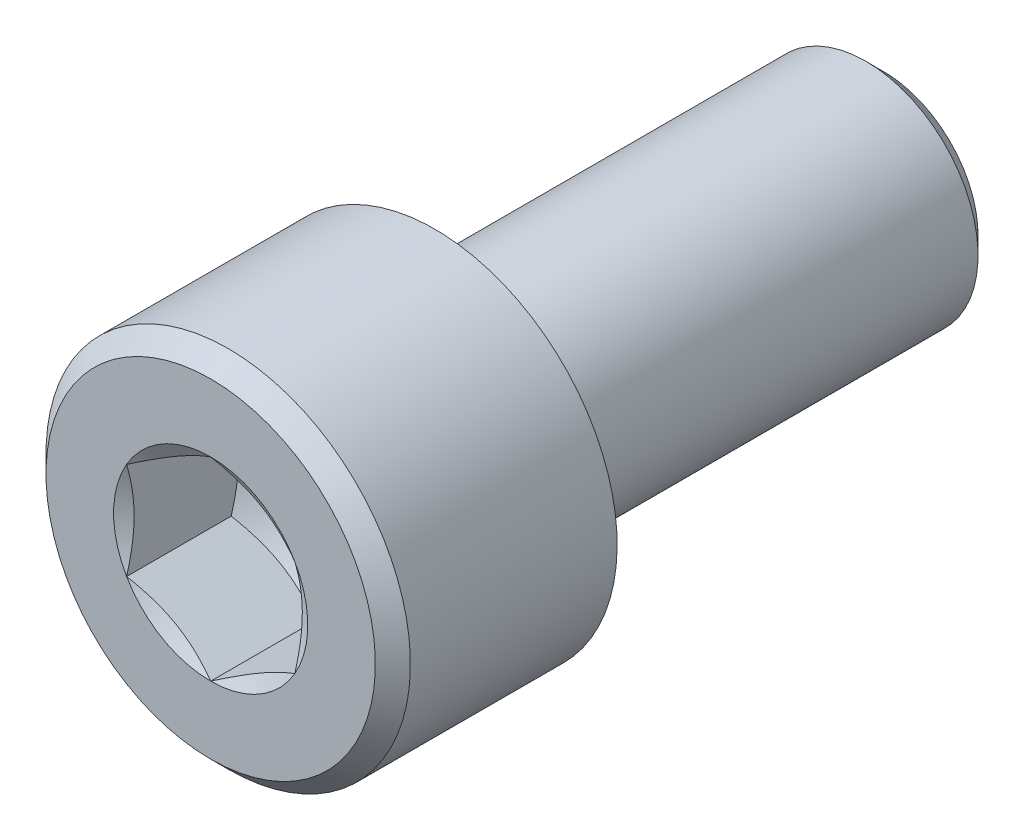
ISO-10303-21;
HEADER;
FILE_DESCRIPTION(('STEP AP214'),'2;1');
FILE_NAME('part.step','',(''),(''),'','','');
FILE_SCHEMA(('AUTOMOTIVE_DESIGN { 1 0 10303 214 1 1 1 1 }'));
ENDSEC;
DATA;
#1=APPLICATION_CONTEXT('core data for automotive mechanical design processes');
#2=APPLICATION_PROTOCOL_DEFINITION('international standard','automotive_design',2000,#1);
#3=PRODUCT_CONTEXT('',#1,'mechanical');
#4=PRODUCT('Part','Part','',(#3));
#5=PRODUCT_RELATED_PRODUCT_CATEGORY('part','',(#4));
#6=PRODUCT_DEFINITION_FORMATION('','',#4);
#7=PRODUCT_DEFINITION_CONTEXT('part definition',#1,'design');
#8=PRODUCT_DEFINITION('design','',#6,#7);
#9=PRODUCT_DEFINITION_SHAPE('','',#8);
#10=(LENGTH_UNIT() NAMED_UNIT(*) SI_UNIT(.MILLI.,.METRE.));
#11=(NAMED_UNIT(*) PLANE_ANGLE_UNIT() SI_UNIT($,.RADIAN.));
#12=(NAMED_UNIT(*) SI_UNIT($,.STERADIAN.) SOLID_ANGLE_UNIT());
#13=UNCERTAINTY_MEASURE_WITH_UNIT(LENGTH_MEASURE(1.E-05),#10,'distance_accuracy_value','');
#14=(GEOMETRIC_REPRESENTATION_CONTEXT(3) GLOBAL_UNCERTAINTY_ASSIGNED_CONTEXT((#13)) GLOBAL_UNIT_ASSIGNED_CONTEXT((#10,
#11,#12)) REPRESENTATION_CONTEXT('',''));
#15=CARTESIAN_POINT('',(0.,0.,0.));
#16=DIRECTION('',(0.,0.,1.));
#17=DIRECTION('',(1.,0.,0.));
#18=AXIS2_PLACEMENT_3D('',#15,#16,#17);
#19=CARTESIAN_POINT('',(0.,6.5,8.));
#20=DIRECTION('',(0.,0.,-1.));
#21=DIRECTION('',(0.,1.,0.));
#22=AXIS2_PLACEMENT_3D('',#19,#20,#21);
#23=PLANE('',#22);
#24=CARTESIAN_POINT('',(0.,0.,8.));
#25=DIRECTION('',(0.,0.,-1.));
#26=DIRECTION('',(0.,1.,0.));
#27=AXIS2_PLACEMENT_3D('',#24,#25,#26);
#28=CIRCLE('',#27,5.875);
#29=CARTESIAN_POINT('',(0.,5.875,8.));
#30=VERTEX_POINT('',#29);
#31=EDGE_CURVE('E297',#30,#30,#28,.F.);
#32=ORIENTED_EDGE('',*,*,#31,.T.);
#33=EDGE_LOOP('',(#32));
#34=FACE_BOUND('',#33,.T.);
#35=CARTESIAN_POINT('',(0.,0.,8.));
#36=DIRECTION('',(0.,0.,-1.));
#37=DIRECTION('',(0.,1.,0.));
#38=AXIS2_PLACEMENT_3D('',#35,#36,#37);
#39=CIRCLE('',#38,3.46410161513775);
#40=CARTESIAN_POINT('',(0.,3.46410161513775,8.));
#41=VERTEX_POINT('',#40);
#42=CARTESIAN_POINT('',(-3.,1.73205080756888,8.));
#43=VERTEX_POINT('',#42);
#44=EDGE_CURVE('E111',#41,#43,#39,.F.);
#45=ORIENTED_EDGE('',*,*,#44,.F.);
#46=CARTESIAN_POINT('',(3.,1.73205080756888,8.));
#47=VERTEX_POINT('',#46);
#48=EDGE_CURVE('E99',#47,#41,#39,.F.);
#49=ORIENTED_EDGE('',*,*,#48,.F.);
#50=CARTESIAN_POINT('',(3.,-1.73205080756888,8.));
#51=VERTEX_POINT('',#50);
#52=EDGE_CURVE('E109',#51,#47,#39,.F.);
#53=ORIENTED_EDGE('',*,*,#52,.F.);
#54=CARTESIAN_POINT('',(0.,-3.46410161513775,8.));
#55=VERTEX_POINT('',#54);
#56=EDGE_CURVE('E440',#55,#51,#39,.F.);
#57=ORIENTED_EDGE('',*,*,#56,.F.);
#58=CARTESIAN_POINT('',(-3.,-1.73205080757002,7.99999999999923));
#59=VERTEX_POINT('',#58);
#60=EDGE_CURVE('E146',#59,#55,#39,.F.);
#61=ORIENTED_EDGE('',*,*,#60,.F.);
#62=EDGE_CURVE('E141',#43,#59,#39,.F.);
#63=ORIENTED_EDGE('',*,*,#62,.F.);
#64=EDGE_LOOP('',(#45,#49,#53,#57,#61,#63));
#65=FACE_BOUND('',#64,.T.);
#66=ADVANCED_FACE('F42',(#34,#65),#23,.F.);
#67=CARTESIAN_POINT('',(0.,4.,0.));
#68=DIRECTION('',(0.,0.,1.));
#69=DIRECTION('',(0.,-1.,0.));
#70=AXIS2_PLACEMENT_3D('',#67,#68,#69);
#71=PLANE('',#70);
#72=CARTESIAN_POINT('',(0.,0.,0.));
#73=DIRECTION('',(0.,0.,1.));
#74=DIRECTION('',(0.,-1.,0.));
#75=AXIS2_PLACEMENT_3D('',#72,#73,#74);
#76=CIRCLE('',#75,4.4);
#77=CARTESIAN_POINT('',(0.,-4.4,0.));
#78=VERTEX_POINT('',#77);
#79=EDGE_CURVE('E51',#78,#78,#76,.T.);
#80=ORIENTED_EDGE('',*,*,#79,.T.);
#81=EDGE_LOOP('',(#80));
#82=FACE_BOUND('',#81,.T.);
#83=CARTESIAN_POINT('',(0.,0.,0.));
#84=DIRECTION('',(0.,0.,1.));
#85=DIRECTION('',(0.,-1.,0.));
#86=AXIS2_PLACEMENT_3D('',#83,#84,#85);
#87=CIRCLE('',#86,6.5);
#88=CARTESIAN_POINT('',(0.,-6.5,0.));
#89=VERTEX_POINT('',#88);
#90=EDGE_CURVE('E448',#89,#89,#87,.T.);
#91=ORIENTED_EDGE('',*,*,#90,.F.);
#92=EDGE_LOOP('',(#91));
#93=FACE_BOUND('',#92,.T.);
#94=ADVANCED_FACE('F259',(#82,#93),#71,.F.);
#95=CARTESIAN_POINT('',(0.,0.,8.));
#96=DIRECTION('',(0.,0.,1.));
#97=DIRECTION('',(0.,-1.,0.));
#98=AXIS2_PLACEMENT_3D('',#95,#96,#97);
#99=CYLINDRICAL_SURFACE('',#98,6.5);
#100=CARTESIAN_POINT('',(0.,0.,7.375));
#101=DIRECTION('',(0.,0.,-1.));
#102=DIRECTION('',(0.,1.,0.));
#103=AXIS2_PLACEMENT_3D('',#100,#101,#102);
#104=CIRCLE('',#103,6.5);
#105=CARTESIAN_POINT('',(0.,6.5,7.375));
#106=VERTEX_POINT('',#105);
#107=EDGE_CURVE('E290',#106,#106,#104,.T.);
#108=ORIENTED_EDGE('',*,*,#107,.T.);
#109=EDGE_LOOP('',(#108));
#110=FACE_BOUND('',#109,.T.);
#111=ORIENTED_EDGE('',*,*,#90,.T.);
#112=EDGE_LOOP('',(#111));
#113=FACE_BOUND('',#112,.T.);
#114=ADVANCED_FACE('F264',(#110,#113),#99,.T.);
#115=CARTESIAN_POINT('',(0.,0.,-16.));
#116=DIRECTION('',(0.,0.,1.));
#117=DIRECTION('',(0.,-1.,0.));
#118=AXIS2_PLACEMENT_3D('',#115,#116,#117);
#119=PLANE('',#118);
#120=CARTESIAN_POINT('',(0.,0.,-16.));
#121=DIRECTION('',(0.,0.,1.));
#122=DIRECTION('',(0.,-1.,0.));
#123=AXIS2_PLACEMENT_3D('',#120,#121,#122);
#124=CIRCLE('',#123,3.375);
#125=CARTESIAN_POINT('',(0.,-3.375,-16.));
#126=VERTEX_POINT('',#125);
#127=EDGE_CURVE('E122',#126,#126,#124,.F.);
#128=ORIENTED_EDGE('',*,*,#127,.T.);
#129=EDGE_LOOP('',(#128));
#130=FACE_BOUND('',#129,.T.);
#131=ADVANCED_FACE('F269',(#130),#119,.F.);
#132=CARTESIAN_POINT('',(0.,0.,8.));
#133=DIRECTION('',(0.,0.,1.));
#134=DIRECTION('',(0.,-1.,0.));
#135=AXIS2_PLACEMENT_3D('',#132,#133,#134);
#136=CYLINDRICAL_SURFACE('',#135,4.);
#137=CARTESIAN_POINT('',(0.,0.,-0.399999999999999));
#138=DIRECTION('',(0.,0.,1.));
#139=DIRECTION('',(0.,-1.,0.));
#140=AXIS2_PLACEMENT_3D('',#137,#138,#139);
#141=CIRCLE('',#140,4.);
#142=CARTESIAN_POINT('',(0.,-4.,-0.399999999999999));
#143=VERTEX_POINT('',#142);
#144=EDGE_CURVE('E12',#143,#143,#141,.F.);
#145=ORIENTED_EDGE('',*,*,#144,.T.);
#146=EDGE_LOOP('',(#145));
#147=FACE_BOUND('',#146,.T.);
#148=CARTESIAN_POINT('',(0.,0.,-15.375));
#149=DIRECTION('',(0.,0.,1.));
#150=DIRECTION('',(0.,-1.,0.));
#151=AXIS2_PLACEMENT_3D('',#148,#149,#150);
#152=CIRCLE('',#151,4.);
#153=CARTESIAN_POINT('',(0.,-4.,-15.375));
#154=VERTEX_POINT('',#153);
#155=EDGE_CURVE('E287',#154,#154,#152,.T.);
#156=ORIENTED_EDGE('',*,*,#155,.T.);
#157=EDGE_LOOP('',(#156));
#158=FACE_BOUND('',#157,.T.);
#159=ADVANCED_FACE('F181',(#147,#158),#136,.T.);
#160=CARTESIAN_POINT('',(0.,0.,8.));
#161=DIRECTION('',(0.,0.,-1.));
#162=DIRECTION('',(0.,1.,0.));
#163=AXIS2_PLACEMENT_3D('',#160,#161,#162);
#164=CONICAL_SURFACE('',#163,5.875,0.785398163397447);
#165=ORIENTED_EDGE('',*,*,#107,.F.);
#166=EDGE_LOOP('',(#165));
#167=FACE_BOUND('',#166,.T.);
#168=ORIENTED_EDGE('',*,*,#31,.F.);
#169=EDGE_LOOP('',(#168));
#170=FACE_BOUND('',#169,.T.);
#171=ADVANCED_FACE('F273',(#167,#170),#164,.T.);
#172=CARTESIAN_POINT('',(0.,0.,-15.375));
#173=DIRECTION('',(0.,0.,1.));
#174=DIRECTION('',(0.,-1.,0.));
#175=AXIS2_PLACEMENT_3D('',#172,#173,#174);
#176=CONICAL_SURFACE('',#175,4.,0.785398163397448);
#177=ORIENTED_EDGE('',*,*,#127,.F.);
#178=EDGE_LOOP('',(#177));
#179=FACE_BOUND('',#178,.T.);
#180=ORIENTED_EDGE('',*,*,#155,.F.);
#181=EDGE_LOOP('',(#180));
#182=FACE_BOUND('',#181,.T.);
#183=ADVANCED_FACE('F275',(#179,#182),#176,.T.);
#184=CARTESIAN_POINT('',(0.,0.,7.73205080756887));
#185=DIRECTION('',(0.,0.,1.));
#186=DIRECTION('',(0.,-1.,0.));
#187=AXIS2_PLACEMENT_3D('',#184,#185,#186);
#188=CONICAL_SURFACE('',#187,3.,1.04719755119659);
#189=ORIENTED_EDGE('',*,*,#44,.T.);
#190=CARTESIAN_POINT('',(-3.0002,1.73193533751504,8.00006666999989));
#191=CARTESIAN_POINT('',(-2.86836479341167,1.80805042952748,7.95610451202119));
#192=CARTESIAN_POINT('',(-2.73539159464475,1.88482254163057,7.91612239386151));
#193=CARTESIAN_POINT('',(-2.46714257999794,2.03969618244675,7.84633288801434));
#194=CARTESIAN_POINT('',(-2.33186199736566,2.11780046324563,7.81655018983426));
#195=CARTESIAN_POINT('',(-2.06297739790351,2.27304105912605,7.77018864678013));
#196=CARTESIAN_POINT('',(-1.92941475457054,2.35015348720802,7.75330124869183));
#197=CARTESIAN_POINT('',(-1.66166094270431,2.50474122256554,7.7331404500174));
#198=CARTESIAN_POINT('',(-1.52747074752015,2.58221596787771,7.72985035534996));
#199=CARTESIAN_POINT('',(-1.27672440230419,2.72698443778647,7.73669133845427));
#200=CARTESIAN_POINT('',(-1.16013073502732,2.79429982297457,7.74514272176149));
#201=CARTESIAN_POINT('',(-0.927703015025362,2.92849202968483,7.77192975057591));
#202=CARTESIAN_POINT('',(-0.811869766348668,2.99536838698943,7.79027454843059));
#203=CARTESIAN_POINT('',(-0.578962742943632,3.12983731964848,7.8361355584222));
#204=CARTESIAN_POINT('',(-0.461918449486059,3.19741287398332,7.86384619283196));
#205=CARTESIAN_POINT('',(-0.229575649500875,3.33155605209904,7.92673860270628));
#206=CARTESIAN_POINT('',(-0.114274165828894,3.39812539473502,7.96190559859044));
#207=CARTESIAN_POINT('',(0.000199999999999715,3.46421708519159,8.00006666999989));
#208=B_SPLINE_CURVE_WITH_KNOTS('',3,(#190,#191,#192,#193,#194,#195,#196,#197,#198,#199,#200,
#201,#202,#203,#204,#205,#206,#207),.UNSPECIFIED.,.F.,.F.,(4,2,2,2,2,2,2,2,4),(0.,
0.475539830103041,0.952222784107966,1.41710776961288,1.88142182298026,2.28572436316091,
2.69040156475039,3.10405572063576,3.5168974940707),.UNSPECIFIED.);
#209=EDGE_CURVE('E115',#43,#41,#208,.T.);
#210=ORIENTED_EDGE('',*,*,#209,.T.);
#211=EDGE_LOOP('',(#189,#210));
#212=FACE_BOUND('',#211,.T.);
#213=ADVANCED_FACE('F116',(#212),#188,.F.);
#214=ORIENTED_EDGE('',*,*,#62,.T.);
#215=CARTESIAN_POINT('',(-3.,-4.59365399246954,9.16763092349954));
#216=CARTESIAN_POINT('',(-3.,-4.46193702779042,9.10397801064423));
#217=CARTESIAN_POINT('',(-3.,-4.32990864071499,9.0409578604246));
#218=CARTESIAN_POINT('',(-3.,-4.065060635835,8.91654466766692));
#219=CARTESIAN_POINT('',(-3.,-3.9322408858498,8.85515190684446));
#220=CARTESIAN_POINT('',(-3.,-3.66492428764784,8.73403165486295));
#221=CARTESIAN_POINT('',(-3.,-3.53042219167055,8.67431570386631));
#222=CARTESIAN_POINT('',(-3.,-3.2603125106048,8.55744874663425));
#223=CARTESIAN_POINT('',(-3.,-3.12470498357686,8.50029760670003));
#224=CARTESIAN_POINT('',(-3.,-2.85048530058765,8.38856379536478));
#225=CARTESIAN_POINT('',(-3.,-2.71185669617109,8.33402127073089));
#226=CARTESIAN_POINT('',(-3.,-2.43296435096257,8.22920798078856));
#227=CARTESIAN_POINT('',(-3.,-2.29270043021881,8.17893769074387));
#228=CARTESIAN_POINT('',(-3.,-2.01060238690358,8.08401961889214));
#229=CARTESIAN_POINT('',(-3.,-1.86877232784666,8.03935988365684));
#230=CARTESIAN_POINT('',(-3.,-1.58309590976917,7.95711332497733));
#231=CARTESIAN_POINT('',(-3.,-1.4392502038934,7.91952426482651));
#232=CARTESIAN_POINT('',(-3.,-1.14944424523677,7.85324390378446));
#233=CARTESIAN_POINT('',(-3.,-1.00348344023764,7.82455497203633));
#234=CARTESIAN_POINT('',(-3.,-0.709802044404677,7.77800648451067));
#235=CARTESIAN_POINT('',(-3.,-0.562081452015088,7.76014693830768));
#236=CARTESIAN_POINT('',(-3.,-0.266588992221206,7.73683716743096));
#237=CARTESIAN_POINT('',(-3.,-0.118823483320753,7.7313083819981));
#238=CARTESIAN_POINT('',(-3.,0.176604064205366,7.73295385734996));
#239=CARTESIAN_POINT('',(-3.,0.324266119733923,7.74012482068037));
#240=CARTESIAN_POINT('',(-3.,0.576420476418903,7.76270985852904));
#241=CARTESIAN_POINT('',(-3.,0.681190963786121,7.77518277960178));
#242=CARTESIAN_POINT('',(-3.,0.889922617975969,7.80571086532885));
#243=CARTESIAN_POINT('',(-3.,0.99388365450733,7.82376691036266));
#244=CARTESIAN_POINT('',(-3.,1.30446784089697,7.88536211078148));
#245=CARTESIAN_POINT('',(-3.,1.50963517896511,7.93631247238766));
#246=CARTESIAN_POINT('',(-3.,1.81663689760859,8.02418807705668));
#247=CARTESIAN_POINT('',(-3.,1.9200715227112,8.0558362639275));
#248=CARTESIAN_POINT('',(-3.,2.12586119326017,8.12226424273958));
#249=CARTESIAN_POINT('',(-3.,2.22821692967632,8.15704187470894));
#250=CARTESIAN_POINT('',(-3.,2.43142080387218,8.22900508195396));
#251=CARTESIAN_POINT('',(-3.,2.5322741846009,8.26617600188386));
#252=CARTESIAN_POINT('',(-3.,2.73319845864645,8.34269957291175));
#253=CARTESIAN_POINT('',(-3.,2.83326901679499,8.38205310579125));
#254=CARTESIAN_POINT('',(-3.,2.93297774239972,8.42228256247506));
#255=B_SPLINE_CURVE_WITH_KNOTS('',3,(#215,#216,#217,#218,#219,#220,#221,#222,#223,#224,#225,
#226,#227,#228,#229,#230,#231,#232,#233,#234,#235,#236,#237,#238,#239,#240,#241,#242,#243,#244,
#245,#246,#247,#248,#249,#250,#251,#252,#253,#254),.UNSPECIFIED.,.F.,.F.,(4,2,2,2,2,2,2,2,2,2,2,
2,2,2,2,2,2,2,2,4),(0.,0.438878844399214,0.877833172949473,1.31929945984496,1.76074270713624,
2.20760550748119,2.65451795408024,3.1004614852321,3.54626371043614,3.99218450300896,
4.43810568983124,4.88117764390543,5.32413457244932,5.64051105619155,5.95693745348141,
6.59026118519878,6.9147396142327,7.23899577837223,7.56142681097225,7.88398906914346),.UNSPECIFIED.);
#256=EDGE_CURVE('E242',#59,#43,#255,.T.);
#257=ORIENTED_EDGE('',*,*,#256,.T.);
#258=EDGE_LOOP('',(#214,#257));
#259=FACE_BOUND('',#258,.T.);
#260=ADVANCED_FACE('F281',(#259),#188,.F.);
#261=ORIENTED_EDGE('',*,*,#60,.T.);
#262=CARTESIAN_POINT('',(0.00020000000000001,-3.46421708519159,8.00006666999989));
#263=CARTESIAN_POINT('',(-0.131635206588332,-3.38810199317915,7.95610451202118));
#264=CARTESIAN_POINT('',(-0.26460840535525,-3.31132988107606,7.91612239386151));
#265=CARTESIAN_POINT('',(-0.532857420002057,-3.15645624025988,7.84633288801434));
#266=CARTESIAN_POINT('',(-0.668138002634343,-3.078351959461,7.81655018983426));
#267=CARTESIAN_POINT('',(-0.937022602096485,-2.92311136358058,7.77018864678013));
#268=CARTESIAN_POINT('',(-1.07058524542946,-2.84599893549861,7.75330124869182));
#269=CARTESIAN_POINT('',(-1.33833905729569,-2.69141120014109,7.7331404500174));
#270=CARTESIAN_POINT('',(-1.47252925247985,-2.61393645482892,7.72985035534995));
#271=CARTESIAN_POINT('',(-1.72327559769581,-2.46916798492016,7.73669133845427));
#272=CARTESIAN_POINT('',(-1.83986926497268,-2.40185259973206,7.74514272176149));
#273=CARTESIAN_POINT('',(-2.07229698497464,-2.2676603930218,7.77192975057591));
#274=CARTESIAN_POINT('',(-2.18813023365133,-2.2007840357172,7.79027454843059));
#275=CARTESIAN_POINT('',(-2.42103725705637,-2.06631510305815,7.8361355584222));
#276=CARTESIAN_POINT('',(-2.53808155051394,-1.99873954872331,7.86384619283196));
#277=CARTESIAN_POINT('',(-2.77042435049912,-1.86459637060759,7.92673860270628));
#278=CARTESIAN_POINT('',(-2.8857258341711,-1.79802702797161,7.96190559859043));
#279=CARTESIAN_POINT('',(-3.0002,-1.73193533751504,8.00006666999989));
#280=B_SPLINE_CURVE_WITH_KNOTS('',3,(#262,#263,#264,#265,#266,#267,#268,#269,#270,#271,#272,
#273,#274,#275,#276,#277,#278,#279),.UNSPECIFIED.,.F.,.F.,(4,2,2,2,2,2,2,2,4),(0.,
0.475539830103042,0.952222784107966,1.41710776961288,1.88142182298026,2.28572436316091,
2.69040156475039,3.10405572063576,3.5168974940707),.UNSPECIFIED.);
#281=EDGE_CURVE('E235',#55,#59,#280,.T.);
#282=ORIENTED_EDGE('',*,*,#281,.T.);
#283=EDGE_LOOP('',(#261,#282));
#284=FACE_BOUND('',#283,.T.);
#285=ADVANCED_FACE('F380',(#284),#188,.F.);
#286=ORIENTED_EDGE('',*,*,#56,.T.);
#287=CARTESIAN_POINT('',(3.0002,-1.73193533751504,8.00006666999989));
#288=CARTESIAN_POINT('',(2.86836479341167,-1.80805042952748,7.95610451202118));
#289=CARTESIAN_POINT('',(2.73539159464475,-1.88482254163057,7.91612239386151));
#290=CARTESIAN_POINT('',(2.46714257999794,-2.03969618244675,7.84633288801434));
#291=CARTESIAN_POINT('',(2.33186199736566,-2.11780046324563,7.81655018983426));
#292=CARTESIAN_POINT('',(2.06297739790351,-2.27304105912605,7.77018864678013));
#293=CARTESIAN_POINT('',(1.92941475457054,-2.35015348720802,7.75330124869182));
#294=CARTESIAN_POINT('',(1.6616609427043,-2.50474122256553,7.7331404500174));
#295=CARTESIAN_POINT('',(1.52747074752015,-2.58221596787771,7.72985035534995));
#296=CARTESIAN_POINT('',(1.27672440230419,-2.72698443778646,7.73669133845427));
#297=CARTESIAN_POINT('',(1.16013073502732,-2.79429982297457,7.74514272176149));
#298=CARTESIAN_POINT('',(0.927703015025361,-2.92849202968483,7.77192975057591));
#299=CARTESIAN_POINT('',(0.811869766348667,-2.99536838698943,7.79027454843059));
#300=CARTESIAN_POINT('',(0.578962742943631,-3.12983731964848,7.8361355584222));
#301=CARTESIAN_POINT('',(0.461918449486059,-3.19741287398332,7.86384619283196));
#302=CARTESIAN_POINT('',(0.229575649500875,-3.33155605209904,7.92673860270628));
#303=CARTESIAN_POINT('',(0.114274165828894,-3.39812539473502,7.96190559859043));
#304=CARTESIAN_POINT('',(-0.00019999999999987,-3.46421708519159,8.00006666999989));
#305=B_SPLINE_CURVE_WITH_KNOTS('',3,(#287,#288,#289,#290,#291,#292,#293,#294,#295,#296,#297,
#298,#299,#300,#301,#302,#303,#304),.UNSPECIFIED.,.F.,.F.,(4,2,2,2,2,2,2,2,4),(0.,
0.475539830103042,0.952222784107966,1.41710776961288,1.88142182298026,2.28572436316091,
2.69040156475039,3.10405572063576,3.5168974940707),.UNSPECIFIED.);
#306=EDGE_CURVE('E63',#51,#55,#305,.T.);
#307=ORIENTED_EDGE('',*,*,#306,.T.);
#308=EDGE_LOOP('',(#286,#307));
#309=FACE_BOUND('',#308,.T.);
#310=ADVANCED_FACE('F373',(#309),#188,.F.);
#311=ORIENTED_EDGE('',*,*,#52,.T.);
#312=CARTESIAN_POINT('',(3.,-4.5936550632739,9.16763144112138));
#313=CARTESIAN_POINT('',(3.,-4.46193806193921,9.10397850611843));
#314=CARTESIAN_POINT('',(3.,-4.32990963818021,9.04095833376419));
#315=CARTESIAN_POINT('',(3.,-4.06506155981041,8.91654509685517));
#316=CARTESIAN_POINT('',(3.,-3.93224177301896,8.855152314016));
#317=CARTESIAN_POINT('',(3.,-3.66492510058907,8.73403201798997));
#318=CARTESIAN_POINT('',(3.,-3.5304229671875,8.6743160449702));
#319=CARTESIAN_POINT('',(3.,-3.26031321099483,8.55744904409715));
#320=CARTESIAN_POINT('',(3.,-3.12470564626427,8.50029788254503));
#321=CARTESIAN_POINT('',(3.,-2.85048588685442,8.38856402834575));
#322=CARTESIAN_POINT('',(3.,-2.71185724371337,8.33402148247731));
#323=CARTESIAN_POINT('',(3.,-2.43296482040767,8.22920815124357));
#324=CARTESIAN_POINT('',(3.,-2.29270086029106,8.17893784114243));
#325=CARTESIAN_POINT('',(3.,-2.01060273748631,8.08401973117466));
#326=CARTESIAN_POINT('',(3.,-1.86877263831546,8.03935997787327));
#327=CARTESIAN_POINT('',(3.,-1.58309613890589,7.95711338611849));
#328=CARTESIAN_POINT('',(3.,-1.43925039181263,7.91952431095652));
#329=CARTESIAN_POINT('',(3.,-1.14944432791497,7.85324391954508));
#330=CARTESIAN_POINT('',(3.,-1.00348345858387,7.82455497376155));
#331=CARTESIAN_POINT('',(3.,-0.709801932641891,7.77800646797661));
#332=CARTESIAN_POINT('',(3.,-0.562081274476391,7.7601469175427));
#333=CARTESIAN_POINT('',(3.,-0.266588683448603,7.73683714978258));
#334=CARTESIAN_POINT('',(3.,-0.118823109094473,7.73130837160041));
#335=CARTESIAN_POINT('',(3.,0.17660456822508,7.73295387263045));
#336=CARTESIAN_POINT('',(3.,0.324266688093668,7.74012485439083));
#337=CARTESIAN_POINT('',(3.,0.576421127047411,7.76270992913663));
#338=CARTESIAN_POINT('',(3.,0.681191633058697,7.77518286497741));
#339=CARTESIAN_POINT('',(3.,0.889923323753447,7.80571098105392));
#340=CARTESIAN_POINT('',(3.,0.99388437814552,7.82376704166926));
#341=CARTESIAN_POINT('',(3.,1.30446861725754,7.88536228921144));
#342=CARTESIAN_POINT('',(3.,1.50963598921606,7.93631268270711));
#343=CARTESIAN_POINT('',(3.,1.81663775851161,8.02418833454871));
#344=CARTESIAN_POINT('',(3.,1.92007240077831,8.05583653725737));
#345=CARTESIAN_POINT('',(3.,2.12586210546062,8.1222645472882));
#346=CARTESIAN_POINT('',(3.,2.22821785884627,8.15704219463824));
#347=CARTESIAN_POINT('',(3.,2.43142176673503,8.22900543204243));
#348=CARTESIAN_POINT('',(3.,2.53227516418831,8.26617636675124));
#349=CARTESIAN_POINT('',(3.,2.73319947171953,8.34269996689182));
#350=CARTESIAN_POINT('',(3.,2.83327004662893,8.38205351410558));
#351=CARTESIAN_POINT('',(3.,2.93297878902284,8.42228298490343));
#352=B_SPLINE_CURVE_WITH_KNOTS('',3,(#312,#313,#314,#315,#316,#317,#318,#319,#320,#321,#322,
#323,#324,#325,#326,#327,#328,#329,#330,#331,#332,#333,#334,#335,#336,#337,#338,#339,#340,#341,
#342,#343,#344,#345,#346,#347,#348,#349,#350,#351),.UNSPECIFIED.,.F.,.F.,(4,2,2,2,2,2,2,2,2,2,2,
2,2,2,2,2,2,2,2,4),(0.,0.438878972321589,0.877833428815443,1.31929984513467,1.76074322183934,
2.20760615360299,2.65451873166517,3.10046239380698,3.54626474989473,3.99218573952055,
4.43810712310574,4.88117927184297,5.32413639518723,5.64051293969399,5.95693939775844,
6.59026325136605,6.91474174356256,7.2389979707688,7.56142906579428,7.88399138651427),.UNSPECIFIED.);
#353=EDGE_CURVE('E57',#47,#51,#352,.F.);
#354=ORIENTED_EDGE('',*,*,#353,.T.);
#355=EDGE_LOOP('',(#311,#354));
#356=FACE_BOUND('',#355,.T.);
#357=ADVANCED_FACE('F366',(#356),#188,.F.);
#358=ORIENTED_EDGE('',*,*,#48,.T.);
#359=CARTESIAN_POINT('',(-0.000199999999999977,3.46421708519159,8.00006666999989));
#360=CARTESIAN_POINT('',(0.131635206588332,3.38810199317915,7.95610451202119));
#361=CARTESIAN_POINT('',(0.26460840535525,3.31132988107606,7.91612239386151));
#362=CARTESIAN_POINT('',(0.532857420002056,3.15645624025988,7.84633288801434));
#363=CARTESIAN_POINT('',(0.668138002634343,3.078351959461,7.81655018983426));
#364=CARTESIAN_POINT('',(0.937022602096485,2.92311136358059,7.77018864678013));
#365=CARTESIAN_POINT('',(1.07058524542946,2.84599893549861,7.75330124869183));
#366=CARTESIAN_POINT('',(1.33833905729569,2.6914112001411,7.7331404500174));
#367=CARTESIAN_POINT('',(1.47252925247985,2.61393645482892,7.72985035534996));
#368=CARTESIAN_POINT('',(1.72327559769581,2.46916798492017,7.73669133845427));
#369=CARTESIAN_POINT('',(1.83986926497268,2.40185259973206,7.74514272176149));
#370=CARTESIAN_POINT('',(2.07229698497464,2.2676603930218,7.77192975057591));
#371=CARTESIAN_POINT('',(2.18813023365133,2.2007840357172,7.79027454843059));
#372=CARTESIAN_POINT('',(2.42103725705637,2.06631510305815,7.8361355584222));
#373=CARTESIAN_POINT('',(2.53808155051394,1.99873954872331,7.86384619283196));
#374=CARTESIAN_POINT('',(2.77042435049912,1.86459637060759,7.92673860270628));
#375=CARTESIAN_POINT('',(2.8857258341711,1.79802702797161,7.96190559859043));
#376=CARTESIAN_POINT('',(3.0002,1.73193533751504,8.00006666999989));
#377=B_SPLINE_CURVE_WITH_KNOTS('',3,(#359,#360,#361,#362,#363,#364,#365,#366,#367,#368,#369,
#370,#371,#372,#373,#374,#375,#376),.UNSPECIFIED.,.F.,.F.,(4,2,2,2,2,2,2,2,4),(0.,
0.475539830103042,0.952222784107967,1.41710776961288,1.88142182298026,2.28572436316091,
2.69040156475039,3.10405572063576,3.5168974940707),.UNSPECIFIED.);
#378=EDGE_CURVE('E103',#41,#47,#377,.T.);
#379=ORIENTED_EDGE('',*,*,#378,.T.);
#380=EDGE_LOOP('',(#358,#379));
#381=FACE_BOUND('',#380,.T.);
#382=ADVANCED_FACE('F101',(#381),#188,.F.);
#383=CARTESIAN_POINT('',(0.,0.,2.26794919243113));
#384=DIRECTION('',(0.,0.,1.));
#385=DIRECTION('',(1.,0.,0.));
#386=AXIS2_PLACEMENT_3D('',#383,#384,#385);
#387=CONICAL_SURFACE('',#386,0.,1.0471975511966);
#388=CARTESIAN_POINT('',(3.0002,-1.73193533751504,4.26801586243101));
#389=CARTESIAN_POINT('',(2.86836479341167,-1.80805042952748,4.2240537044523));
#390=CARTESIAN_POINT('',(2.73539159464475,-1.88482254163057,4.18407158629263));
#391=CARTESIAN_POINT('',(2.46714257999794,-2.03969618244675,4.11428208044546));
#392=CARTESIAN_POINT('',(2.33186199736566,-2.11780046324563,4.08449938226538));
#393=CARTESIAN_POINT('',(2.06297739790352,-2.27304105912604,4.03813783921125));
#394=CARTESIAN_POINT('',(1.92941475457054,-2.35015348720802,4.02125044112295));
#395=CARTESIAN_POINT('',(1.66166094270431,-2.50474122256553,4.00108964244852));
#396=CARTESIAN_POINT('',(1.52747074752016,-2.58221596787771,3.99779954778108));
#397=CARTESIAN_POINT('',(1.27672440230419,-2.72698443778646,4.00464053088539));
#398=CARTESIAN_POINT('',(1.16013073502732,-2.79429982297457,4.01309191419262));
#399=CARTESIAN_POINT('',(0.927703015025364,-2.92849202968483,4.03987894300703));
#400=CARTESIAN_POINT('',(0.811869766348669,-2.99536838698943,4.05822374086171));
#401=CARTESIAN_POINT('',(0.578962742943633,-3.12983731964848,4.10408475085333));
#402=CARTESIAN_POINT('',(0.46191844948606,-3.19741287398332,4.13179538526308));
#403=CARTESIAN_POINT('',(0.229575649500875,-3.33155605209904,4.1946877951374));
#404=CARTESIAN_POINT('',(0.114274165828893,-3.39812539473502,4.22985479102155));
#405=CARTESIAN_POINT('',(-0.00020000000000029,-3.46421708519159,4.26801586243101));
#406=B_SPLINE_CURVE_WITH_KNOTS('',3,(#388,#389,#390,#391,#392,#393,#394,#395,#396,#397,#398,
#399,#400,#401,#402,#403,#404,#405),.UNSPECIFIED.,.F.,.F.,(4,2,2,2,2,2,2,2,4),(0.,
0.475539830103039,0.952222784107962,1.41710776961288,1.88142182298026,2.28572436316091,
2.69040156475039,3.10405572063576,3.5168974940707),.UNSPECIFIED.);
#407=CARTESIAN_POINT('',(3.,-1.73205080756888,4.26794919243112));
#408=VERTEX_POINT('',#407);
#409=CARTESIAN_POINT('',(0.,-3.46410161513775,4.26794919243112));
#410=VERTEX_POINT('',#409);
#411=EDGE_CURVE('E195',#408,#410,#406,.T.);
#412=ORIENTED_EDGE('',*,*,#411,.F.);
#413=CARTESIAN_POINT('',(3.,-4.67276344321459,5.47391853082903));
#414=CARTESIAN_POINT('',(3.,-4.54147492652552,5.4101506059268));
#415=CARTESIAN_POINT('',(3.,-4.40988701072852,5.34698863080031));
#416=CARTESIAN_POINT('',(3.,-4.14595305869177,5.2222172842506));
#417=CARTESIAN_POINT('',(3.,-4.01360690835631,5.1606081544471));
#418=CARTESIAN_POINT('',(3.,-3.74732607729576,5.03897809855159));
#419=CARTESIAN_POINT('',(3.,-3.61338668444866,4.97896745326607));
#420=CARTESIAN_POINT('',(3.,-3.34444862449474,4.8613778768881));
#421=CARTESIAN_POINT('',(3.,-3.20945000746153,4.80379883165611));
#422=CARTESIAN_POINT('',(3.,-2.93392610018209,4.68995731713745));
#423=CARTESIAN_POINT('',(3.,-2.79336018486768,4.63379263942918));
#424=CARTESIAN_POINT('',(3.,-2.51059186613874,4.52566524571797));
#425=CARTESIAN_POINT('',(3.,-2.36838928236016,4.47370299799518));
#426=CARTESIAN_POINT('',(3.,-2.08238011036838,4.37532836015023));
#427=CARTESIAN_POINT('',(3.,-1.93857734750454,4.32890495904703));
#428=CARTESIAN_POINT('',(3.,-1.64891025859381,4.24308341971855));
#429=CARTESIAN_POINT('',(3.,-1.50304659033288,4.20368309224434));
#430=CARTESIAN_POINT('',(3.,-1.20989864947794,4.13397239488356));
#431=CARTESIAN_POINT('',(3.,-1.06262520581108,4.10361732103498));
#432=CARTESIAN_POINT('',(3.,-0.766227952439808,4.0537312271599));
#433=CARTESIAN_POINT('',(3.,-0.617104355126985,4.03419897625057));
#434=CARTESIAN_POINT('',(3.,-0.319699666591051,4.00777020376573));
#435=CARTESIAN_POINT('',(3.,-0.17143347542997,4.00071014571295));
#436=CARTESIAN_POINT('',(3.,0.125174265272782,3.99939280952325));
#437=CARTESIAN_POINT('',(3.,0.273515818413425,4.00513621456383));
#438=CARTESIAN_POINT('',(3.,0.52461167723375,4.02528675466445));
#439=CARTESIAN_POINT('',(3.,0.627633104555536,4.0365616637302));
#440=CARTESIAN_POINT('',(3.,0.832933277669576,4.06459754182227));
#441=CARTESIAN_POINT('',(3.,0.935211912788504,4.08135931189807));
#442=CARTESIAN_POINT('',(3.,1.2408182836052,4.13900209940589));
#443=CARTESIAN_POINT('',(3.,1.44277662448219,4.18722787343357));
#444=CARTESIAN_POINT('',(3.,1.74506887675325,4.271045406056));
#445=CARTESIAN_POINT('',(3.,1.84696047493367,4.3013395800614));
#446=CARTESIAN_POINT('',(3.,2.04969161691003,4.36509135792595));
#447=CARTESIAN_POINT('',(3.,2.15053174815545,4.39854707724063));
#448=CARTESIAN_POINT('',(3.,2.35128029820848,4.46810611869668));
#449=CARTESIAN_POINT('',(3.,2.45118876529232,4.50420930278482));
#450=CARTESIAN_POINT('',(3.,2.65019024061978,4.57863192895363));
#451=CARTESIAN_POINT('',(3.,2.74928313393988,4.61695167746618));
#452=CARTESIAN_POINT('',(3.,2.96480343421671,4.70262071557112));
#453=CARTESIAN_POINT('',(3.,3.08108383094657,4.75033893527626));
#454=CARTESIAN_POINT('',(3.,3.31276064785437,4.8478793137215));
#455=CARTESIAN_POINT('',(3.,3.42815703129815,4.89770155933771));
#456=CARTESIAN_POINT('',(3.,3.77325355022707,5.04974840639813));
#457=CARTESIAN_POINT('',(3.,4.0018229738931,5.15453767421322));
#458=CARTESIAN_POINT('',(3.,4.45687408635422,5.36883530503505));
#459=CARTESIAN_POINT('',(3.,4.68335453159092,5.47834628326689));
#460=CARTESIAN_POINT('',(3.,5.13468376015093,5.70069081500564));
#461=CARTESIAN_POINT('',(3.,5.35953248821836,5.81352448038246));
#462=CARTESIAN_POINT('',(3.,5.80851444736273,6.04187462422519));
#463=CARTESIAN_POINT('',(3.,6.0326448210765,6.15739670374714));
#464=CARTESIAN_POINT('',(3.,6.47995800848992,6.39026864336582));
#465=CARTESIAN_POINT('',(3.,6.70314080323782,6.50761853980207));
#466=CARTESIAN_POINT('',(3.,7.37142136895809,6.86164816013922));
#467=CARTESIAN_POINT('',(3.,7.81542265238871,7.10039587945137));
#468=CARTESIAN_POINT('',(3.,8.63669853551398,7.54608610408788));
#469=CARTESIAN_POINT('',(3.,9.01422468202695,7.75256723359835));
#470=CARTESIAN_POINT('',(3.,9.76835016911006,8.167312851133));
#471=CARTESIAN_POINT('',(3.,10.1449494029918,8.37557753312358));
#472=CARTESIAN_POINT('',(3.,10.8958481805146,8.79249093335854));
#473=CARTESIAN_POINT('',(3.,11.2701507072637,9.00113428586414));
#474=CARTESIAN_POINT('',(3.,12.0181718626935,9.41935949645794));
#475=CARTESIAN_POINT('',(3.,12.3918905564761,9.62894123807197));
#476=CARTESIAN_POINT('',(3.,12.7654203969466,9.83885750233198));
#477=B_SPLINE_CURVE_WITH_KNOTS('',3,(#413,#414,#415,#416,#417,#418,#419,#420,#421,#422,#423,
#424,#425,#426,#427,#428,#429,#430,#431,#432,#433,#434,#435,#436,#437,#438,#439,#440,#441,#442,
#443,#444,#445,#446,#447,#448,#449,#450,#451,#452,#453,#454,#455,#456,#457,#458,#459,#460,#461,
#462,#463,#464,#465,#466,#467,#468,#469,#470,#471,#472,#473,#474,#475,#476),.UNSPECIFIED.,.F.,
.F.,(4,2,2,2,2,2,2,2,2,2,2,2,2,2,2,2,2,2,2,2,2,2,2,2,2,2,2,2,2,2,2,4),(0.,0.437871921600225,
0.875811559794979,1.31609817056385,1.75636409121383,2.21042581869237,2.6645380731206,
3.11773197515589,3.5707843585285,4.0215590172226,4.47228239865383,4.91705072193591,
5.36184277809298,5.67260254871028,5.98340770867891,6.60543742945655,6.92430888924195,
7.24299145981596,7.56165742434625,7.88036754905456,8.25741348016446,8.63447499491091,
9.38872124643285,10.1433907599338,10.8980857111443,11.6545260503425,12.4109814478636,
13.9233143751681,15.2142183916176,16.5052646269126,17.7908408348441,19.076261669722),.UNSPECIFIED.);
#478=CARTESIAN_POINT('',(3.,1.73205080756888,4.26794919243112));
#479=VERTEX_POINT('',#478);
#480=EDGE_CURVE('E202',#479,#408,#477,.F.);
#481=ORIENTED_EDGE('',*,*,#480,.F.);
#482=CARTESIAN_POINT('',(-0.000200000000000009,3.46421708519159,4.26801586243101));
#483=CARTESIAN_POINT('',(0.131635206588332,3.38810199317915,4.22405370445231));
#484=CARTESIAN_POINT('',(0.264608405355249,3.31132988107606,4.18407158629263));
#485=CARTESIAN_POINT('',(0.532857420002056,3.15645624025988,4.11428208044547));
#486=CARTESIAN_POINT('',(0.668138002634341,3.078351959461,4.08449938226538));
#487=CARTESIAN_POINT('',(0.937022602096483,2.92311136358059,4.03813783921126));
#488=CARTESIAN_POINT('',(1.07058524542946,2.84599893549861,4.02125044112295));
#489=CARTESIAN_POINT('',(1.33833905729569,2.6914112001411,4.00108964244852));
#490=CARTESIAN_POINT('',(1.47252925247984,2.61393645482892,3.99779954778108));
#491=CARTESIAN_POINT('',(1.72327559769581,2.46916798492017,4.00464053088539));
#492=CARTESIAN_POINT('',(1.83986926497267,2.40185259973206,4.01309191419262));
#493=CARTESIAN_POINT('',(2.07229698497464,2.2676603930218,4.03987894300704));
#494=CARTESIAN_POINT('',(2.18813023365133,2.2007840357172,4.05822374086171));
#495=CARTESIAN_POINT('',(2.42103725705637,2.06631510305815,4.10408475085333));
#496=CARTESIAN_POINT('',(2.53808155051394,1.99873954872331,4.13179538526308));
#497=CARTESIAN_POINT('',(2.77042435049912,1.86459637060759,4.1946877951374));
#498=CARTESIAN_POINT('',(2.8857258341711,1.79802702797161,4.22985479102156));
#499=CARTESIAN_POINT('',(3.0002,1.73193533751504,4.26801586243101));
#500=B_SPLINE_CURVE_WITH_KNOTS('',3,(#482,#483,#484,#485,#486,#487,#488,#489,#490,#491,#492,
#493,#494,#495,#496,#497,#498,#499),.UNSPECIFIED.,.F.,.F.,(4,2,2,2,2,2,2,2,4),(0.,
0.47553983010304,0.952222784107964,1.41710776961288,1.88142182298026,2.28572436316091,
2.69040156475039,3.10405572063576,3.5168974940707),.UNSPECIFIED.);
#501=CARTESIAN_POINT('',(0.,3.46410161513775,4.26794919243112));
#502=VERTEX_POINT('',#501);
#503=EDGE_CURVE('E210',#502,#479,#500,.T.);
#504=ORIENTED_EDGE('',*,*,#503,.F.);
#505=CARTESIAN_POINT('',(-3.0002,1.73193533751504,4.26801586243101));
#506=CARTESIAN_POINT('',(-2.86836479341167,1.80805042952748,4.22405370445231));
#507=CARTESIAN_POINT('',(-2.73539159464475,1.88482254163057,4.18407158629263));
#508=CARTESIAN_POINT('',(-2.46714257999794,2.03969618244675,4.11428208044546));
#509=CARTESIAN_POINT('',(-2.33186199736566,2.11780046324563,4.08449938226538));
#510=CARTESIAN_POINT('',(-2.06297739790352,2.27304105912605,4.03813783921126));
#511=CARTESIAN_POINT('',(-1.92941475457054,2.35015348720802,4.02125044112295));
#512=CARTESIAN_POINT('',(-1.66166094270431,2.50474122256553,4.00108964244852));
#513=CARTESIAN_POINT('',(-1.52747074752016,2.58221596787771,3.99779954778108));
#514=CARTESIAN_POINT('',(-1.27672440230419,2.72698443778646,4.00464053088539));
#515=CARTESIAN_POINT('',(-1.16013073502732,2.79429982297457,4.01309191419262));
#516=CARTESIAN_POINT('',(-0.927703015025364,2.92849202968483,4.03987894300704));
#517=CARTESIAN_POINT('',(-0.811869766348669,2.99536838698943,4.05822374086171));
#518=CARTESIAN_POINT('',(-0.578962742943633,3.12983731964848,4.10408475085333));
#519=CARTESIAN_POINT('',(-0.46191844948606,3.19741287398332,4.13179538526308));
#520=CARTESIAN_POINT('',(-0.229575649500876,3.33155605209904,4.1946877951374));
#521=CARTESIAN_POINT('',(-0.114274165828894,3.39812539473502,4.22985479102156));
#522=CARTESIAN_POINT('',(0.000199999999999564,3.46421708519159,4.26801586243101));
#523=B_SPLINE_CURVE_WITH_KNOTS('',3,(#505,#506,#507,#508,#509,#510,#511,#512,#513,#514,#515,
#516,#517,#518,#519,#520,#521,#522),.UNSPECIFIED.,.F.,.F.,(4,2,2,2,2,2,2,2,4),(0.,
0.47553983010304,0.952222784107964,1.41710776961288,1.88142182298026,2.28572436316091,
2.69040156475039,3.10405572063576,3.5168974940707),.UNSPECIFIED.);
#524=CARTESIAN_POINT('',(-3.,1.73205080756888,4.26794919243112));
#525=VERTEX_POINT('',#524);
#526=EDGE_CURVE('E134',#525,#502,#523,.T.);
#527=ORIENTED_EDGE('',*,*,#526,.F.);
#528=CARTESIAN_POINT('',(-3.,-4.67276344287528,5.47391853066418));
#529=CARTESIAN_POINT('',(-3.,-4.54147492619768,5.41015060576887));
#530=CARTESIAN_POINT('',(-3.,-4.40988701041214,5.34698863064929));
#531=CARTESIAN_POINT('',(-3.,-4.14595305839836,5.22221728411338));
#532=CARTESIAN_POINT('',(-3.,-4.01360690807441,5.16060815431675));
#533=CARTESIAN_POINT('',(-3.,-3.74732607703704,5.038978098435));
#534=CARTESIAN_POINT('',(-3.,-3.61338668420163,4.97896745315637));
#535=CARTESIAN_POINT('',(-3.,-3.34444862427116,4.86137787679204));
#536=CARTESIAN_POINT('',(-3.,-3.20945000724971,4.80379883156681));
#537=CARTESIAN_POINT('',(-3.,-2.93392609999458,4.68995731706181));
#538=CARTESIAN_POINT('',(-3.,-2.79336018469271,4.63379263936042));
#539=CARTESIAN_POINT('',(-3.,-2.51059186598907,4.52566524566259));
#540=CARTESIAN_POINT('',(-3.,-2.36838928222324,4.47370299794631));
#541=CARTESIAN_POINT('',(-3.,-2.0823801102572,4.37532836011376));
#542=CARTESIAN_POINT('',(-3.,-1.93857734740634,4.32890495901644));
#543=CARTESIAN_POINT('',(-3.,-1.64891025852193,4.24308341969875));
#544=CARTESIAN_POINT('',(-3.,-1.50304659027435,4.20368309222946));
#545=CARTESIAN_POINT('',(-3.,-1.20989864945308,4.13397239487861));
#546=CARTESIAN_POINT('',(-3.,-1.06262520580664,4.10361732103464));
#547=CARTESIAN_POINT('',(-3.,-0.766227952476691,4.0537312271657));
#548=CARTESIAN_POINT('',(-3.,-0.617104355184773,4.03419897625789));
#549=CARTESIAN_POINT('',(-3.,-0.319699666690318,4.00777020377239));
#550=CARTESIAN_POINT('',(-3.,-0.171433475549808,4.00071014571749));
#551=CARTESIAN_POINT('',(-3.,0.125174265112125,3.99939280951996));
#552=CARTESIAN_POINT('',(-3.,0.273515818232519,4.00513621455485));
#553=CARTESIAN_POINT('',(-3.,0.524611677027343,4.02528675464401));
#554=CARTESIAN_POINT('',(-3.,0.627633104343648,4.03656166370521));
#555=CARTESIAN_POINT('',(-3.,0.832933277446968,4.06459754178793));
#556=CARTESIAN_POINT('',(-3.,0.935211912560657,4.08135931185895));
#557=CARTESIAN_POINT('',(-3.,1.2408182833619,4.13900209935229));
#558=CARTESIAN_POINT('',(-3.,1.44277662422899,4.1872278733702));
#559=CARTESIAN_POINT('',(-3.,1.74506887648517,4.27104540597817));
#560=CARTESIAN_POINT('',(-3.,1.84696047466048,4.30133957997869));
#561=CARTESIAN_POINT('',(-3.,2.04969161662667,4.36509135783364));
#562=CARTESIAN_POINT('',(-3.,2.15053174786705,4.3985470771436));
#563=CARTESIAN_POINT('',(-3.,2.35128029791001,4.46810611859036));
#564=CARTESIAN_POINT('',(-3.,2.45118876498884,4.50420930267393));
#565=CARTESIAN_POINT('',(-3.,2.65019024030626,4.57863192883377));
#566=CARTESIAN_POINT('',(-3.,2.74928313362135,4.61695167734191));
#567=CARTESIAN_POINT('',(-3.,2.96480343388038,4.70262071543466));
#568=CARTESIAN_POINT('',(-3.,3.08108383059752,4.75033893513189));
#569=CARTESIAN_POINT('',(-3.,3.31276064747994,4.84787931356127));
#570=CARTESIAN_POINT('',(-3.,3.42815703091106,4.89770155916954));
#571=CARTESIAN_POINT('',(-3.,3.77325354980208,5.0497484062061));
#572=CARTESIAN_POINT('',(-3.,4.00182297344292,5.15453767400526));
#573=CARTESIAN_POINT('',(-3.,4.45687408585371,5.36883530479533));
#574=CARTESIAN_POINT('',(-3.,4.68335453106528,5.47834628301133));
#575=CARTESIAN_POINT('',(-3.,5.13468375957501,5.70069081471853));
#576=CARTESIAN_POINT('',(-3.,5.35953248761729,5.81352448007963));
#577=CARTESIAN_POINT('',(-3.,5.80851444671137,6.04187462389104));
#578=CARTESIAN_POINT('',(-3.,6.03264482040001,6.1573967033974));
#579=CARTESIAN_POINT('',(-3.,6.47995800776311,6.39026864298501));
#580=CARTESIAN_POINT('',(-3.,6.70314080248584,6.50761853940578));
#581=CARTESIAN_POINT('',(-3.,7.37142136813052,6.86164815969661));
#582=CARTESIAN_POINT('',(-3.,7.81542265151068,7.10039587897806));
#583=CARTESIAN_POINT('',(-3.,8.63669853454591,7.54608610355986));
#584=CARTESIAN_POINT('',(-3.,9.0142246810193,7.75256723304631));
#585=CARTESIAN_POINT('',(-3.,9.76835016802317,8.1673128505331));
#586=CARTESIAN_POINT('',(-3.,10.1449494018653,8.37557753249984));
#587=CARTESIAN_POINT('',(-3.,10.8958481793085,8.79249093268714));
#588=CARTESIAN_POINT('',(-3.,11.2701507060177,9.00113428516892));
#589=CARTESIAN_POINT('',(-3.,12.0181718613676,9.41935949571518));
#590=CARTESIAN_POINT('',(-3.,12.3918905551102,9.62894123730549));
#591=CARTESIAN_POINT('',(-3.,12.7654203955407,9.83885750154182));
#592=B_SPLINE_CURVE_WITH_KNOTS('',3,(#528,#529,#530,#531,#532,#533,#534,#535,#536,#537,#538,
#539,#540,#541,#542,#543,#544,#545,#546,#547,#548,#549,#550,#551,#552,#553,#554,#555,#556,#557,
#558,#559,#560,#561,#562,#563,#564,#565,#566,#567,#568,#569,#570,#571,#572,#573,#574,#575,#576,
#577,#578,#579,#580,#581,#582,#583,#584,#585,#586,#587,#588,#589,#590,#591),.UNSPECIFIED.,.F.,
.F.,(4,2,2,2,2,2,2,2,2,2,2,2,2,2,2,2,2,2,2,2,2,2,2,2,2,2,2,2,2,2,2,4),(0.,0.437871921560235,
0.875811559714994,1.31609817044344,1.75636409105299,2.21042581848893,2.66453807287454,
3.11773197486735,3.57078435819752,4.02155901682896,4.47228239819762,4.9170507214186,
5.36184277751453,5.672602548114,5.9834077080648,6.60543742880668,6.92430888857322,
7.24299145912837,7.56165742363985,7.88036754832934,8.25741347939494,8.63447499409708,
9.3887212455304,10.1433907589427,10.8980857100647,11.6545260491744,12.410981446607,
13.9233143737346,15.2142183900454,16.5052646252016,17.7908408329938,19.0762616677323),.UNSPECIFIED.);
#593=CARTESIAN_POINT('',(-3.,-1.73205080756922,4.26794919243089));
#594=VERTEX_POINT('',#593);
#595=EDGE_CURVE('E155',#594,#525,#592,.T.);
#596=ORIENTED_EDGE('',*,*,#595,.F.);
#597=CARTESIAN_POINT('',(0.0002,-3.46421708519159,4.26801586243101));
#598=CARTESIAN_POINT('',(-0.131635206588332,-3.38810199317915,4.2240537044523));
#599=CARTESIAN_POINT('',(-0.264608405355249,-3.31132988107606,4.18407158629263));
#600=CARTESIAN_POINT('',(-0.532857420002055,-3.15645624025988,4.11428208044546));
#601=CARTESIAN_POINT('',(-0.668138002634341,-3.078351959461,4.08449938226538));
#602=CARTESIAN_POINT('',(-0.937022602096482,-2.92311136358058,4.03813783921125));
#603=CARTESIAN_POINT('',(-1.07058524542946,-2.84599893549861,4.02125044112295));
#604=CARTESIAN_POINT('',(-1.33833905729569,-2.6914112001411,4.00108964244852));
#605=CARTESIAN_POINT('',(-1.47252925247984,-2.61393645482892,3.99779954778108));
#606=CARTESIAN_POINT('',(-1.7232755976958,-2.46916798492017,4.00464053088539));
#607=CARTESIAN_POINT('',(-1.83986926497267,-2.40185259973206,4.01309191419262));
#608=CARTESIAN_POINT('',(-2.07229698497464,-2.2676603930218,4.03987894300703));
#609=CARTESIAN_POINT('',(-2.18813023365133,-2.2007840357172,4.05822374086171));
#610=CARTESIAN_POINT('',(-2.42103725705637,-2.06631510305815,4.10408475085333));
#611=CARTESIAN_POINT('',(-2.53808155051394,-1.99873954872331,4.13179538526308));
#612=CARTESIAN_POINT('',(-2.77042435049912,-1.86459637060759,4.1946877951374));
#613=CARTESIAN_POINT('',(-2.8857258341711,-1.79802702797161,4.22985479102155));
#614=CARTESIAN_POINT('',(-3.0002,-1.73193533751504,4.26801586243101));
#615=B_SPLINE_CURVE_WITH_KNOTS('',3,(#597,#598,#599,#600,#601,#602,#603,#604,#605,#606,#607,
#608,#609,#610,#611,#612,#613,#614),.UNSPECIFIED.,.F.,.F.,(4,2,2,2,2,2,2,2,4),(0.,
0.47553983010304,0.952222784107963,1.41710776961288,1.88142182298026,2.28572436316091,
2.69040156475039,3.10405572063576,3.5168974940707),.UNSPECIFIED.);
#616=EDGE_CURVE('E165',#410,#594,#615,.T.);
#617=ORIENTED_EDGE('',*,*,#616,.F.);
#618=EDGE_LOOP('',(#412,#481,#504,#527,#596,#617));
#619=FACE_BOUND('',#618,.T.);
#620=CARTESIAN_POINT('',(0.,0.,2.26794919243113));
#621=VERTEX_POINT('',#620);
#622=VERTEX_LOOP('',#621);
#623=FACE_BOUND('',#622,.T.);
#624=ADVANCED_FACE('F175',(#619,#623),#387,.F.);
#625=CARTESIAN_POINT('',(0.,3.46410161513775,-16.001));
#626=DIRECTION('',(-0.5,0.866025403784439,0.));
#627=DIRECTION('',(-0.866025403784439,-0.5,0.));
#628=AXIS2_PLACEMENT_3D('',#625,#626,#627);
#629=PLANE('',#628);
#630=ORIENTED_EDGE('',*,*,#209,.F.);
#631=DIRECTION('',(0.,0.,1.));
#632=VECTOR('',#631,1.);
#633=CARTESIAN_POINT('',(-3.,1.73205080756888,-16.001));
#634=LINE('',#633,#632);
#635=EDGE_CURVE('E136',#525,#43,#634,.T.);
#636=ORIENTED_EDGE('',*,*,#635,.F.);
#637=ORIENTED_EDGE('',*,*,#526,.T.);
#638=DIRECTION('',(0.,0.,1.));
#639=VECTOR('',#638,1.);
#640=CARTESIAN_POINT('',(0.,3.46410161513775,-16.001));
#641=LINE('',#640,#639);
#642=EDGE_CURVE('E127',#502,#41,#641,.T.);
#643=ORIENTED_EDGE('',*,*,#642,.T.);
#644=EDGE_LOOP('',(#630,#636,#637,#643));
#645=FACE_BOUND('',#644,.T.);
#646=ADVANCED_FACE('F133',(#645),#629,.F.);
#647=CARTESIAN_POINT('',(-3.,1.73205080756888,-16.001));
#648=DIRECTION('',(-1.,0.,0.));
#649=DIRECTION('',(0.,-1.,0.));
#650=AXIS2_PLACEMENT_3D('',#647,#648,#649);
#651=PLANE('',#650);
#652=ORIENTED_EDGE('',*,*,#256,.F.);
#653=DIRECTION('',(0.,0.,1.));
#654=VECTOR('',#653,1.);
#655=CARTESIAN_POINT('',(-3.,-1.73205080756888,-16.001));
#656=LINE('',#655,#654);
#657=EDGE_CURVE('E432',#594,#59,#656,.T.);
#658=ORIENTED_EDGE('',*,*,#657,.F.);
#659=ORIENTED_EDGE('',*,*,#595,.T.);
#660=ORIENTED_EDGE('',*,*,#635,.T.);
#661=EDGE_LOOP('',(#652,#658,#659,#660));
#662=FACE_BOUND('',#661,.T.);
#663=ADVANCED_FACE('F172',(#662),#651,.F.);
#664=CARTESIAN_POINT('',(-3.,-1.73205080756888,-16.001));
#665=DIRECTION('',(-0.5,-0.866025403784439,0.));
#666=DIRECTION('',(0.866025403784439,-0.5,0.));
#667=AXIS2_PLACEMENT_3D('',#664,#665,#666);
#668=PLANE('',#667);
#669=ORIENTED_EDGE('',*,*,#281,.F.);
#670=DIRECTION('',(0.,0.,1.));
#671=VECTOR('',#670,1.);
#672=CARTESIAN_POINT('',(0.,-3.46410161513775,-16.001));
#673=LINE('',#672,#671);
#674=EDGE_CURVE('E437',#410,#55,#673,.T.);
#675=ORIENTED_EDGE('',*,*,#674,.F.);
#676=ORIENTED_EDGE('',*,*,#616,.T.);
#677=ORIENTED_EDGE('',*,*,#657,.T.);
#678=EDGE_LOOP('',(#669,#675,#676,#677));
#679=FACE_BOUND('',#678,.T.);
#680=ADVANCED_FACE('F247',(#679),#668,.F.);
#681=CARTESIAN_POINT('',(0.,-3.46410161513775,-16.001));
#682=DIRECTION('',(0.5,-0.866025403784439,0.));
#683=DIRECTION('',(0.866025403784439,0.5,0.));
#684=AXIS2_PLACEMENT_3D('',#681,#682,#683);
#685=PLANE('',#684);
#686=ORIENTED_EDGE('',*,*,#306,.F.);
#687=DIRECTION('',(0.,0.,1.));
#688=VECTOR('',#687,1.);
#689=CARTESIAN_POINT('',(3.,-1.73205080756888,-16.001));
#690=LINE('',#689,#688);
#691=EDGE_CURVE('E460',#408,#51,#690,.T.);
#692=ORIENTED_EDGE('',*,*,#691,.F.);
#693=ORIENTED_EDGE('',*,*,#411,.T.);
#694=ORIENTED_EDGE('',*,*,#674,.T.);
#695=EDGE_LOOP('',(#686,#692,#693,#694));
#696=FACE_BOUND('',#695,.T.);
#697=ADVANCED_FACE('F219',(#696),#685,.F.);
#698=CARTESIAN_POINT('',(3.,-1.73205080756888,-16.001));
#699=DIRECTION('',(1.,0.,0.));
#700=DIRECTION('',(0.,1.,0.));
#701=AXIS2_PLACEMENT_3D('',#698,#699,#700);
#702=PLANE('',#701);
#703=ORIENTED_EDGE('',*,*,#353,.F.);
#704=DIRECTION('',(0.,0.,1.));
#705=VECTOR('',#704,1.);
#706=CARTESIAN_POINT('',(3.,1.73205080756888,-16.001));
#707=LINE('',#706,#705);
#708=EDGE_CURVE('E129',#479,#47,#707,.T.);
#709=ORIENTED_EDGE('',*,*,#708,.F.);
#710=ORIENTED_EDGE('',*,*,#480,.T.);
#711=ORIENTED_EDGE('',*,*,#691,.T.);
#712=EDGE_LOOP('',(#703,#709,#710,#711));
#713=FACE_BOUND('',#712,.T.);
#714=ADVANCED_FACE('F216',(#713),#702,.F.);
#715=CARTESIAN_POINT('',(3.,1.73205080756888,-16.001));
#716=DIRECTION('',(0.5,0.866025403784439,0.));
#717=DIRECTION('',(-0.866025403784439,0.5,0.));
#718=AXIS2_PLACEMENT_3D('',#715,#716,#717);
#719=PLANE('',#718);
#720=ORIENTED_EDGE('',*,*,#378,.F.);
#721=ORIENTED_EDGE('',*,*,#642,.F.);
#722=ORIENTED_EDGE('',*,*,#503,.T.);
#723=ORIENTED_EDGE('',*,*,#708,.T.);
#724=EDGE_LOOP('',(#720,#721,#722,#723));
#725=FACE_BOUND('',#724,.T.);
#726=ADVANCED_FACE('F126',(#725),#719,.F.);
#727=CARTESIAN_POINT('',(0.,0.,-0.399999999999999));
#728=DIRECTION('',(0.,0.,1.));
#729=DIRECTION('',(0.,-1.,0.));
#730=AXIS2_PLACEMENT_3D('',#727,#728,#729);
#731=TOROIDAL_SURFACE('',#730,4.4,0.4);
#732=ORIENTED_EDGE('',*,*,#144,.F.);
#733=EDGE_LOOP('',(#732));
#734=FACE_BOUND('',#733,.T.);
#735=ORIENTED_EDGE('',*,*,#79,.F.);
#736=EDGE_LOOP('',(#735));
#737=FACE_BOUND('',#736,.T.);
#738=ADVANCED_FACE('F44',(#734,#737),#731,.F.);
#739=CLOSED_SHELL('',(#66,#94,#114,#131,#159,#171,#183,#213,#260,#285,#310,#357,#382,#624,#646,
#663,#680,#697,#714,#726,#738));
#740=MANIFOLD_SOLID_BREP('B2',#739);
#741=ADVANCED_BREP_SHAPE_REPRESENTATION('',(#18,#740),#14);
#742=SHAPE_DEFINITION_REPRESENTATION(#9,#741);
ENDSEC;
END-ISO-10303-21;
